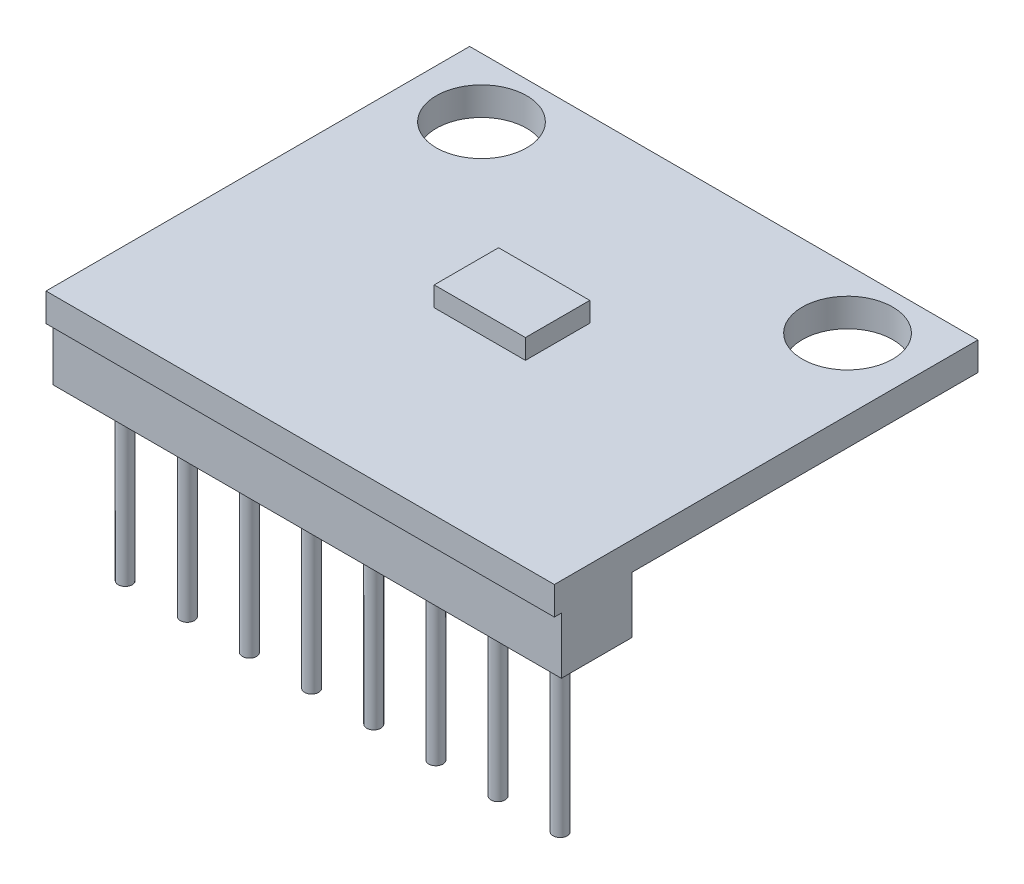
from build123d import *

# Parameters (mm, degrees)
SKETCH_2_W      = 18
SKETCH_2_H      = 15
SKETCH_2_R      = 1.6
EXTRUDE_1_DEPTH = 1
SKETCH_3_W      = 3.230120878
SKETCH_3_H      = 2.27902973
EXTRUDE_2_DEPTH = 0.7
SKETCH_4_W      = 18
SKETCH_4_H      = 2.5
EXTRUDE_3_DEPTH = 2
SKETCH_5_R      = 0.250691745
EXTRUDE_4_DEPTH = 6


with BuildPart() as part:
    # Sketch 2 → Extrude 1 (new body)
    with BuildSketch(Plane(origin=(0, 0, 0), x_dir=(1, 0, 0), z_dir=(0, 1, 0))):
        Rectangle(SKETCH_2_W, SKETCH_2_H)
        with Locations(Location((-6.48, 5.4, 0), (0, 0, 270))):
            Circle(SKETCH_2_R, mode=Mode.SUBTRACT)
        with Locations(Location((6.48, 5.4, 0), (0, 0, 90))):
            Circle(SKETCH_2_R, mode=Mode.SUBTRACT)
    extrude(amount=-EXTRUDE_1_DEPTH)

    # Sketch 3 → Extrude 2 (add)
    with BuildSketch(Plane(origin=(0, 0, 0), x_dir=(1, 0, 0), z_dir=(0, 1, 0))):
        Rectangle(SKETCH_3_W, SKETCH_3_H)
    extrude(amount=EXTRUDE_2_DEPTH)

    # Sketch 4 → Extrude 3 (add)
    with BuildSketch(Plane.XZ.offset(1)):
        with Locations((0, 6.002641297)):
            Rectangle(SKETCH_4_W, SKETCH_4_H)
    extrude(amount=EXTRUDE_3_DEPTH)

    # Sketch 5 → Extrude 4 (add)
    with BuildSketch(Plane.XZ.offset(3)):
        with Locations(Location((-7.714381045, 5.980433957, 0), (0, 0, 270))):
            Circle(SKETCH_5_R)
        with Locations(Location((-5.514381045, 5.980433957, 0), (0, 0, 270))):
            Circle(SKETCH_5_R)
        with Locations(Location((-3.314381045, 5.980433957, 0), (0, 0, 270))):
            Circle(SKETCH_5_R)
        with Locations(Location((-1.114381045, 5.980433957, 0), (0, 0, 270))):
            Circle(SKETCH_5_R)
        with Locations(Location((1.085618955, 5.980433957, 0), (0, 0, 270))):
            Circle(SKETCH_5_R)
        with Locations(Location((3.285618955, 5.980433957, 0), (0, 0, 270))):
            Circle(SKETCH_5_R)
        with Locations(Location((5.485618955, 5.980433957, 0), (0, 0, 270))):
            Circle(SKETCH_5_R)
        with Locations(Location((7.685618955, 5.980433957, 0), (0, 0, 270))):
            Circle(SKETCH_5_R)
    extrude(amount=EXTRUDE_4_DEPTH)


solid = part.part
